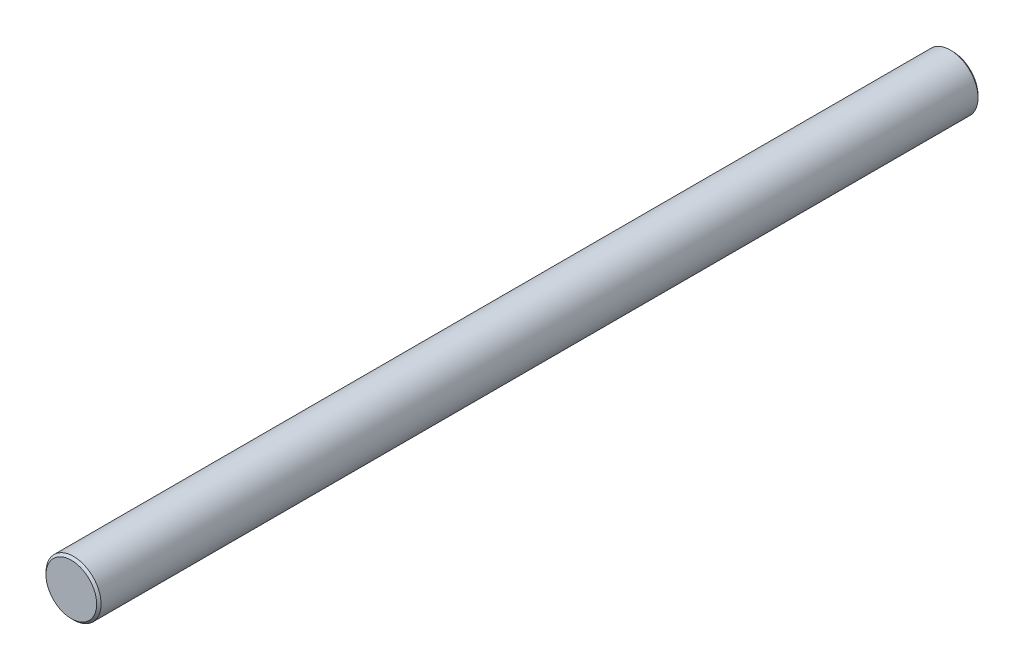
from build123d import *

# Parameters (mm, degrees)
SKETCH2_R      = 9.525
EXTRUDE2_DEPTH = 304.8
CHAMFER1_SIZE  = 0.762


with BuildPart() as part:
    # Sketch2 → Extrude2 (new body)
    with BuildSketch(Plane.XY):
        with Locations(Location((0, 0, 0), (0, 0, 180))):
            Circle(SKETCH2_R)
    extrude(amount=EXTRUDE2_DEPTH)

    # Chamfer1
    chamfer1_edges = [part.edges().sort_by_distance(p)[0] for p in [
        (9.525, 0, 0),
        (9.525, 0, 304.8),
    ]]
    chamfer(chamfer1_edges, length=CHAMFER1_SIZE)


solid = part.part
